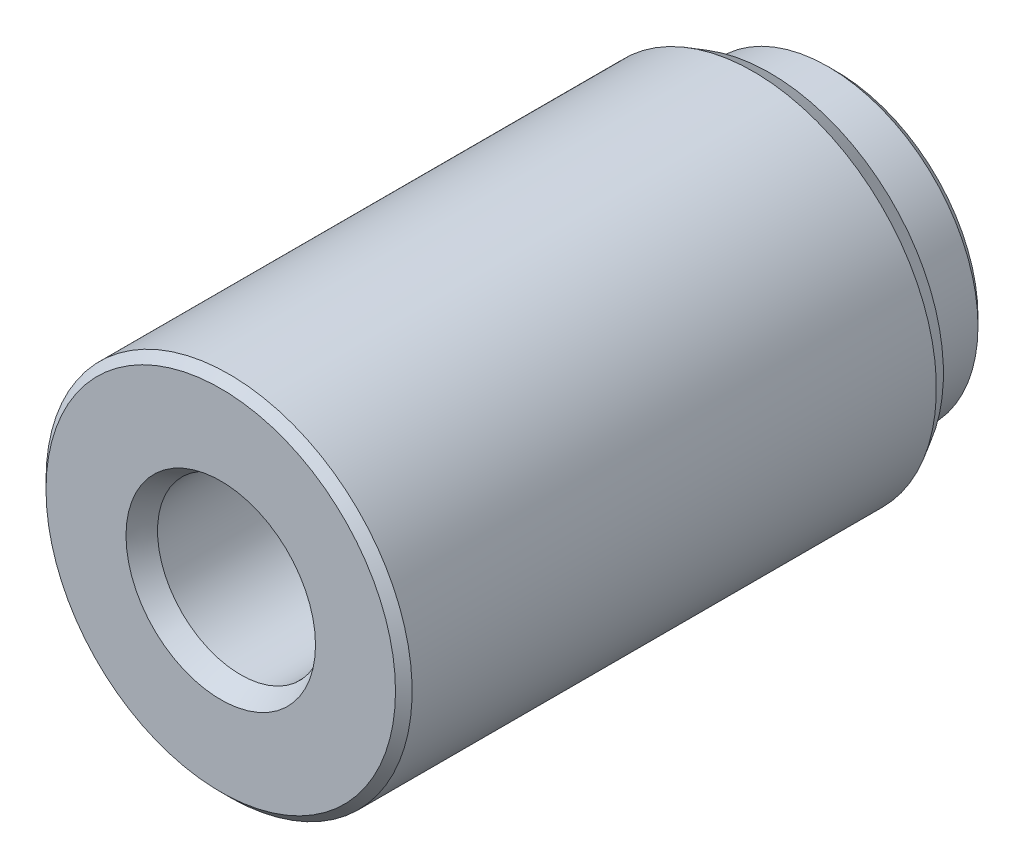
ISO-10303-21;
HEADER;
FILE_DESCRIPTION(('STEP AP214'),'2;1');
FILE_NAME('part.step','',(''),(''),'','','');
FILE_SCHEMA(('AUTOMOTIVE_DESIGN { 1 0 10303 214 1 1 1 1 }'));
ENDSEC;
DATA;
#1=APPLICATION_CONTEXT('core data for automotive mechanical design processes');
#2=APPLICATION_PROTOCOL_DEFINITION('international standard','automotive_design',2000,#1);
#3=PRODUCT_CONTEXT('',#1,'mechanical');
#4=PRODUCT('Part','Part','',(#3));
#5=PRODUCT_RELATED_PRODUCT_CATEGORY('part','',(#4));
#6=PRODUCT_DEFINITION_FORMATION('','',#4);
#7=PRODUCT_DEFINITION_CONTEXT('part definition',#1,'design');
#8=PRODUCT_DEFINITION('design','',#6,#7);
#9=PRODUCT_DEFINITION_SHAPE('','',#8);
#10=(LENGTH_UNIT() NAMED_UNIT(*) SI_UNIT(.MILLI.,.METRE.));
#11=(NAMED_UNIT(*) PLANE_ANGLE_UNIT() SI_UNIT($,.RADIAN.));
#12=(NAMED_UNIT(*) SI_UNIT($,.STERADIAN.) SOLID_ANGLE_UNIT());
#13=UNCERTAINTY_MEASURE_WITH_UNIT(LENGTH_MEASURE(1.E-05),#10,'distance_accuracy_value','');
#14=(GEOMETRIC_REPRESENTATION_CONTEXT(3) GLOBAL_UNCERTAINTY_ASSIGNED_CONTEXT((#13)) GLOBAL_UNIT_ASSIGNED_CONTEXT((#10,
#11,#12)) REPRESENTATION_CONTEXT('',''));
#15=CARTESIAN_POINT('',(0.,0.,0.));
#16=DIRECTION('',(0.,0.,1.));
#17=DIRECTION('',(1.,0.,0.));
#18=AXIS2_PLACEMENT_3D('',#15,#16,#17);
#19=CARTESIAN_POINT('',(0.,0.,37.));
#20=DIRECTION('',(0.,0.,1.));
#21=DIRECTION('',(1.,0.,0.));
#22=AXIS2_PLACEMENT_3D('',#19,#20,#21);
#23=CYLINDRICAL_SURFACE('',#22,4.25);
#24=CARTESIAN_POINT('',(0.,0.,1.5));
#25=DIRECTION('',(0.,0.,1.));
#26=DIRECTION('',(1.,0.,0.));
#27=AXIS2_PLACEMENT_3D('',#24,#25,#26);
#28=CIRCLE('',#27,4.25);
#29=CARTESIAN_POINT('',(4.25,0.,1.5));
#30=VERTEX_POINT('',#29);
#31=EDGE_CURVE('E8',#30,#30,#28,.F.);
#32=ORIENTED_EDGE('',*,*,#31,.T.);
#33=EDGE_LOOP('',(#32));
#34=FACE_BOUND('',#33,.T.);
#35=CARTESIAN_POINT('',(0.,0.,17.));
#36=DIRECTION('',(0.,0.,1.));
#37=DIRECTION('',(1.,0.,0.));
#38=AXIS2_PLACEMENT_3D('',#35,#36,#37);
#39=CIRCLE('',#38,4.25);
#40=CARTESIAN_POINT('',(4.25,0.,17.));
#41=VERTEX_POINT('',#40);
#42=EDGE_CURVE('E16',#41,#41,#39,.F.);
#43=ORIENTED_EDGE('',*,*,#42,.F.);
#44=EDGE_LOOP('',(#43));
#45=FACE_BOUND('',#44,.T.);
#46=ADVANCED_FACE('F12',(#34,#45),#23,.F.);
#47=CARTESIAN_POINT('',(0.,0.,-10.2629383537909));
#48=DIRECTION('',(0.,0.,-1.));
#49=DIRECTION('',(-1.,0.,0.));
#50=AXIS2_PLACEMENT_3D('',#47,#48,#49);
#51=CYLINDRICAL_SURFACE('',#50,11.);
#52=CARTESIAN_POINT('',(0.,0.,5.));
#53=DIRECTION('',(0.,0.,-1.));
#54=DIRECTION('',(-1.,0.,0.));
#55=AXIS2_PLACEMENT_3D('',#52,#53,#54);
#56=CIRCLE('',#55,11.);
#57=CARTESIAN_POINT('',(-11.,0.,5.));
#58=VERTEX_POINT('',#57);
#59=EDGE_CURVE('E51',#58,#58,#56,.T.);
#60=ORIENTED_EDGE('',*,*,#59,.F.);
#61=EDGE_LOOP('',(#60));
#62=FACE_BOUND('',#61,.T.);
#63=CARTESIAN_POINT('',(0.,0.,36.5));
#64=DIRECTION('',(0.,0.,-1.));
#65=DIRECTION('',(-1.,0.,0.));
#66=AXIS2_PLACEMENT_3D('',#63,#64,#65);
#67=CIRCLE('',#66,11.);
#68=CARTESIAN_POINT('',(-11.,0.,36.5));
#69=VERTEX_POINT('',#68);
#70=EDGE_CURVE('E54',#69,#69,#67,.T.);
#71=ORIENTED_EDGE('',*,*,#70,.T.);
#72=EDGE_LOOP('',(#71));
#73=FACE_BOUND('',#72,.T.);
#74=ADVANCED_FACE('F82',(#62,#73),#51,.T.);
#75=CARTESIAN_POINT('',(0.,0.,37.));
#76=DIRECTION('',(0.,0.,-1.));
#77=DIRECTION('',(-1.,0.,0.));
#78=AXIS2_PLACEMENT_3D('',#75,#76,#77);
#79=PLANE('',#78);
#80=CARTESIAN_POINT('',(0.,0.,37.));
#81=DIRECTION('',(0.,0.,-1.));
#82=DIRECTION('',(-1.,0.,0.));
#83=AXIS2_PLACEMENT_3D('',#80,#81,#82);
#84=CIRCLE('',#83,5.69337567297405);
#85=CARTESIAN_POINT('',(-5.69337567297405,0.,37.));
#86=VERTEX_POINT('',#85);
#87=EDGE_CURVE('E25',#86,#86,#84,.T.);
#88=ORIENTED_EDGE('',*,*,#87,.T.);
#89=EDGE_LOOP('',(#88));
#90=FACE_BOUND('',#89,.T.);
#91=CARTESIAN_POINT('',(0.,0.,37.));
#92=DIRECTION('',(0.,0.,-1.));
#93=DIRECTION('',(-1.,0.,0.));
#94=AXIS2_PLACEMENT_3D('',#91,#92,#93);
#95=CIRCLE('',#94,10.5);
#96=CARTESIAN_POINT('',(-10.5,0.,37.));
#97=VERTEX_POINT('',#96);
#98=EDGE_CURVE('E57',#97,#97,#95,.T.);
#99=ORIENTED_EDGE('',*,*,#98,.F.);
#100=EDGE_LOOP('',(#99));
#101=FACE_BOUND('',#100,.T.);
#102=ADVANCED_FACE('F62',(#90,#101),#79,.F.);
#103=CARTESIAN_POINT('',(0.,0.,37.));
#104=DIRECTION('',(0.,0.,-1.));
#105=DIRECTION('',(-1.,0.,0.));
#106=AXIS2_PLACEMENT_3D('',#103,#104,#105);
#107=CONICAL_SURFACE('',#106,10.5,0.785398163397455);
#108=ORIENTED_EDGE('',*,*,#70,.F.);
#109=EDGE_LOOP('',(#108));
#110=FACE_BOUND('',#109,.T.);
#111=ORIENTED_EDGE('',*,*,#98,.T.);
#112=EDGE_LOOP('',(#111));
#113=FACE_BOUND('',#112,.T.);
#114=ADVANCED_FACE('F108',(#110,#113),#107,.T.);
#115=CARTESIAN_POINT('',(0.,0.,5.));
#116=DIRECTION('',(0.,0.,1.));
#117=DIRECTION('',(1.,0.,0.));
#118=AXIS2_PLACEMENT_3D('',#115,#116,#117);
#119=CONICAL_SURFACE('',#118,11.,0.523598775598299);
#120=CARTESIAN_POINT('',(0.,0.,4.));
#121=DIRECTION('',(0.,0.,-1.));
#122=DIRECTION('',(-1.,0.,0.));
#123=AXIS2_PLACEMENT_3D('',#120,#121,#122);
#124=CIRCLE('',#123,10.4226497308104);
#125=CARTESIAN_POINT('',(-10.4226497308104,0.,4.));
#126=VERTEX_POINT('',#125);
#127=EDGE_CURVE('E48',#126,#126,#124,.T.);
#128=ORIENTED_EDGE('',*,*,#127,.F.);
#129=EDGE_LOOP('',(#128));
#130=FACE_BOUND('',#129,.T.);
#131=ORIENTED_EDGE('',*,*,#59,.T.);
#132=EDGE_LOOP('',(#131));
#133=FACE_BOUND('',#132,.T.);
#134=ADVANCED_FACE('F105',(#130,#133),#119,.T.);
#135=CARTESIAN_POINT('',(10.4226497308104,0.,4.));
#136=DIRECTION('',(0.,0.,1.));
#137=DIRECTION('',(1.,0.,0.));
#138=AXIS2_PLACEMENT_3D('',#135,#136,#137);
#139=PLANE('',#138);
#140=CARTESIAN_POINT('',(0.,0.,4.));
#141=DIRECTION('',(0.,0.,-1.));
#142=DIRECTION('',(-1.,0.,0.));
#143=AXIS2_PLACEMENT_3D('',#140,#141,#142);
#144=CIRCLE('',#143,9.);
#145=CARTESIAN_POINT('',(-9.,0.,4.));
#146=VERTEX_POINT('',#145);
#147=EDGE_CURVE('E45',#146,#146,#144,.T.);
#148=ORIENTED_EDGE('',*,*,#147,.F.);
#149=EDGE_LOOP('',(#148));
#150=FACE_BOUND('',#149,.T.);
#151=ORIENTED_EDGE('',*,*,#127,.T.);
#152=EDGE_LOOP('',(#151));
#153=FACE_BOUND('',#152,.T.);
#154=ADVANCED_FACE('F101',(#150,#153),#139,.F.);
#155=CARTESIAN_POINT('',(0.,0.,-10.2629383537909));
#156=DIRECTION('',(0.,0.,-1.));
#157=DIRECTION('',(-1.,0.,0.));
#158=AXIS2_PLACEMENT_3D('',#155,#156,#157);
#159=CYLINDRICAL_SURFACE('',#158,9.);
#160=CARTESIAN_POINT('',(0.,0.,0.500000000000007));
#161=DIRECTION('',(0.,0.,-1.));
#162=DIRECTION('',(-1.,0.,0.));
#163=AXIS2_PLACEMENT_3D('',#160,#161,#162);
#164=CIRCLE('',#163,9.);
#165=CARTESIAN_POINT('',(-9.,0.,0.500000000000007));
#166=VERTEX_POINT('',#165);
#167=EDGE_CURVE('E42',#166,#166,#164,.T.);
#168=ORIENTED_EDGE('',*,*,#167,.F.);
#169=EDGE_LOOP('',(#168));
#170=FACE_BOUND('',#169,.T.);
#171=ORIENTED_EDGE('',*,*,#147,.T.);
#172=EDGE_LOOP('',(#171));
#173=FACE_BOUND('',#172,.T.);
#174=ADVANCED_FACE('F97',(#170,#173),#159,.T.);
#175=CARTESIAN_POINT('',(0.,0.,0.500000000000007));
#176=DIRECTION('',(0.,0.,1.));
#177=DIRECTION('',(1.,0.,0.));
#178=AXIS2_PLACEMENT_3D('',#175,#176,#177);
#179=CONICAL_SURFACE('',#178,9.,0.785398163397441);
#180=CARTESIAN_POINT('',(0.,0.,0.));
#181=DIRECTION('',(0.,0.,-1.));
#182=DIRECTION('',(-1.,0.,0.));
#183=AXIS2_PLACEMENT_3D('',#180,#181,#182);
#184=CIRCLE('',#183,8.5);
#185=CARTESIAN_POINT('',(-8.5,0.,0.));
#186=VERTEX_POINT('',#185);
#187=EDGE_CURVE('E34',#186,#186,#184,.T.);
#188=ORIENTED_EDGE('',*,*,#187,.F.);
#189=EDGE_LOOP('',(#188));
#190=FACE_BOUND('',#189,.T.);
#191=ORIENTED_EDGE('',*,*,#167,.T.);
#192=EDGE_LOOP('',(#191));
#193=FACE_BOUND('',#192,.T.);
#194=ADVANCED_FACE('F77',(#190,#193),#179,.T.);
#195=CARTESIAN_POINT('',(8.5,0.,0.));
#196=DIRECTION('',(0.,0.,1.));
#197=DIRECTION('',(1.,0.,0.));
#198=AXIS2_PLACEMENT_3D('',#195,#196,#197);
#199=PLANE('',#198);
#200=CARTESIAN_POINT('',(0.,0.,0.));
#201=DIRECTION('',(0.,0.,1.));
#202=DIRECTION('',(1.,0.,0.));
#203=AXIS2_PLACEMENT_3D('',#200,#201,#202);
#204=CIRCLE('',#203,5.11602540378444);
#205=CARTESIAN_POINT('',(5.11602540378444,0.,0.));
#206=VERTEX_POINT('',#205);
#207=EDGE_CURVE('E20',#206,#206,#204,.T.);
#208=ORIENTED_EDGE('',*,*,#207,.T.);
#209=EDGE_LOOP('',(#208));
#210=FACE_BOUND('',#209,.T.);
#211=ORIENTED_EDGE('',*,*,#187,.T.);
#212=EDGE_LOOP('',(#211));
#213=FACE_BOUND('',#212,.T.);
#214=ADVANCED_FACE('F67',(#210,#213),#199,.F.);
#215=CARTESIAN_POINT('',(0.,0.,34.5));
#216=DIRECTION('',(0.,0.,1.));
#217=DIRECTION('',(1.,0.,0.));
#218=AXIS2_PLACEMENT_3D('',#215,#216,#217);
#219=CONICAL_SURFACE('',#218,4.25,0.523598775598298);
#220=CARTESIAN_POINT('',(0.,0.,35.7990381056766));
#221=DIRECTION('',(0.,0.,1.));
#222=DIRECTION('',(1.,0.,0.));
#223=AXIS2_PLACEMENT_3D('',#220,#221,#222);
#224=CIRCLE('',#223,5.);
#225=CARTESIAN_POINT('',(5.,0.,35.7990381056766));
#226=VERTEX_POINT('',#225);
#227=EDGE_CURVE('E28',#226,#226,#224,.T.);
#228=ORIENTED_EDGE('',*,*,#227,.F.);
#229=EDGE_LOOP('',(#228));
#230=FACE_BOUND('',#229,.T.);
#231=ORIENTED_EDGE('',*,*,#87,.F.);
#232=EDGE_LOOP('',(#231));
#233=FACE_BOUND('',#232,.T.);
#234=ADVANCED_FACE('F65',(#230,#233),#219,.F.);
#235=CARTESIAN_POINT('',(0.,0.,0.));
#236=DIRECTION('',(0.,0.,-1.));
#237=DIRECTION('',(-1.,0.,0.));
#238=AXIS2_PLACEMENT_3D('',#235,#236,#237);
#239=CONICAL_SURFACE('',#238,5.11602540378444,0.523598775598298);
#240=ORIENTED_EDGE('',*,*,#31,.F.);
#241=EDGE_LOOP('',(#240));
#242=FACE_BOUND('',#241,.T.);
#243=ORIENTED_EDGE('',*,*,#207,.F.);
#244=EDGE_LOOP('',(#243));
#245=FACE_BOUND('',#244,.T.);
#246=ADVANCED_FACE('F14',(#242,#245),#239,.F.);
#247=CARTESIAN_POINT('',(0.,0.,17.));
#248=DIRECTION('',(0.,0.,1.));
#249=DIRECTION('',(1.,0.,0.));
#250=AXIS2_PLACEMENT_3D('',#247,#248,#249);
#251=PLANE('',#250);
#252=CARTESIAN_POINT('',(0.,0.,17.));
#253=DIRECTION('',(0.,0.,1.));
#254=DIRECTION('',(1.,0.,0.));
#255=AXIS2_PLACEMENT_3D('',#252,#253,#254);
#256=CIRCLE('',#255,5.);
#257=CARTESIAN_POINT('',(5.,0.,17.));
#258=VERTEX_POINT('',#257);
#259=EDGE_CURVE('E30',#258,#258,#256,.T.);
#260=ORIENTED_EDGE('',*,*,#259,.T.);
#261=EDGE_LOOP('',(#260));
#262=FACE_BOUND('',#261,.T.);
#263=ORIENTED_EDGE('',*,*,#42,.T.);
#264=EDGE_LOOP('',(#263));
#265=FACE_BOUND('',#264,.T.);
#266=ADVANCED_FACE('F75',(#262,#265),#251,.T.);
#267=CARTESIAN_POINT('',(0.,0.,17.));
#268=DIRECTION('',(0.,0.,1.));
#269=DIRECTION('',(1.,0.,0.));
#270=AXIS2_PLACEMENT_3D('',#267,#268,#269);
#271=CYLINDRICAL_SURFACE('',#270,5.);
#272=ORIENTED_EDGE('',*,*,#227,.T.);
#273=EDGE_LOOP('',(#272));
#274=FACE_BOUND('',#273,.T.);
#275=ORIENTED_EDGE('',*,*,#259,.F.);
#276=EDGE_LOOP('',(#275));
#277=FACE_BOUND('',#276,.T.);
#278=ADVANCED_FACE('F92',(#274,#277),#271,.F.);
#279=CLOSED_SHELL('',(#46,#74,#102,#114,#134,#154,#174,#194,#214,#234,#246,#266,#278));
#280=MANIFOLD_SOLID_BREP('B1',#279);
#281=ADVANCED_BREP_SHAPE_REPRESENTATION('',(#18,#280),#14);
#282=SHAPE_DEFINITION_REPRESENTATION(#9,#281);
ENDSEC;
END-ISO-10303-21;
